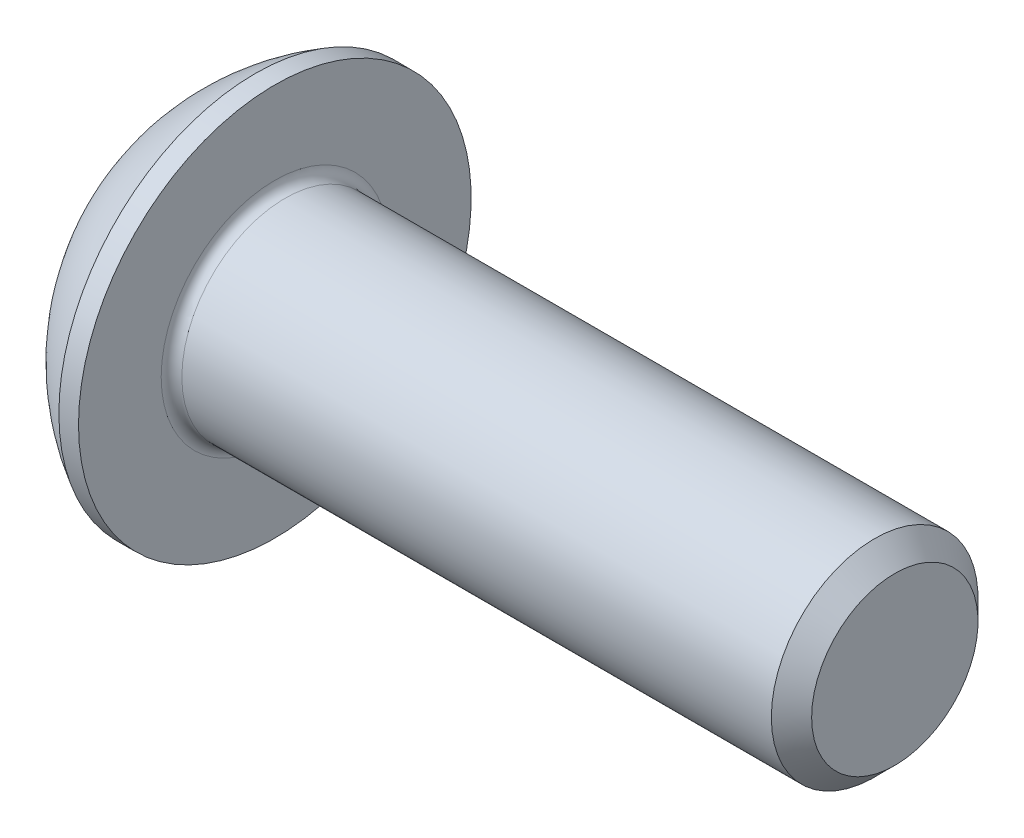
from build123d import *

# Parameters (mm, degrees)
FILLET1_R   = 0.2
HEX_2_DEPTH = 1.3


with BuildPart() as part:
    # BodySke → BaseBody (revolve)
    with BuildSketch(Plane.XY, mode=Mode.PRIVATE) as basebody_sk:
        with BuildLine():
            Line((14.2, 0), (14.2, 1.61))
            Line((14.2, 1.61), (13.81, 2))
            Line((13.81, 2), (2.2, 2))
            Line((2.2, 2), (2.2, 3.8))
            Line((2.2, 3.8), (1.82, 3.8))
            ThreePointArc((1.82, 3.8), (0.762013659, 2.991755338), (0, 1.9))
            Line((0, 1.9), (0, 0))
            Line((0, 0), (14.2, 0))
        make_face()
    revolve(basebody_sk.sketch.rotate(Axis((0, 0, 0), (1, 0, 0)), 90), axis=Axis((0, 0, 0), (1, 0, 0)))

    # Fillet1
    fillet1_edges = [part.edges().sort_by_distance(p)[0] for p in [
        (2.2, 0, -2),
    ]]
    fillet(fillet1_edges, radius=FILLET1_R)

    # Sketch2 → PreBroach (revolve, cut)
    with BuildSketch(Plane.XY, mode=Mode.PRIVATE) as prebroach_sk:
        Polygon((0, 1.25), (1.3, 1.25), (2.021687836, 0), (0, 0), align=None)
    revolve(prebroach_sk.sketch.rotate(Axis((0, 0, 0), (1, 0, 0)), 90), axis=Axis((0, 0, 0), (1, 0, 0)), mode=Mode.SUBTRACT)

    # Sketch3 → Hex 2 (cut)
    with BuildSketch(Plane(origin=(0, 0, 0), x_dir=(0, 0, -1), z_dir=(1, 0, 0))):
        Polygon((-1.25, -0.721687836), (-1.25, 0.721687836), (0, 1.443375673), (1.25, 0.721687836), (1.25, -0.721687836), (0, -1.443375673), align=None)
    extrude(amount=HEX_2_DEPTH, mode=Mode.SUBTRACT)


solid = part.part
